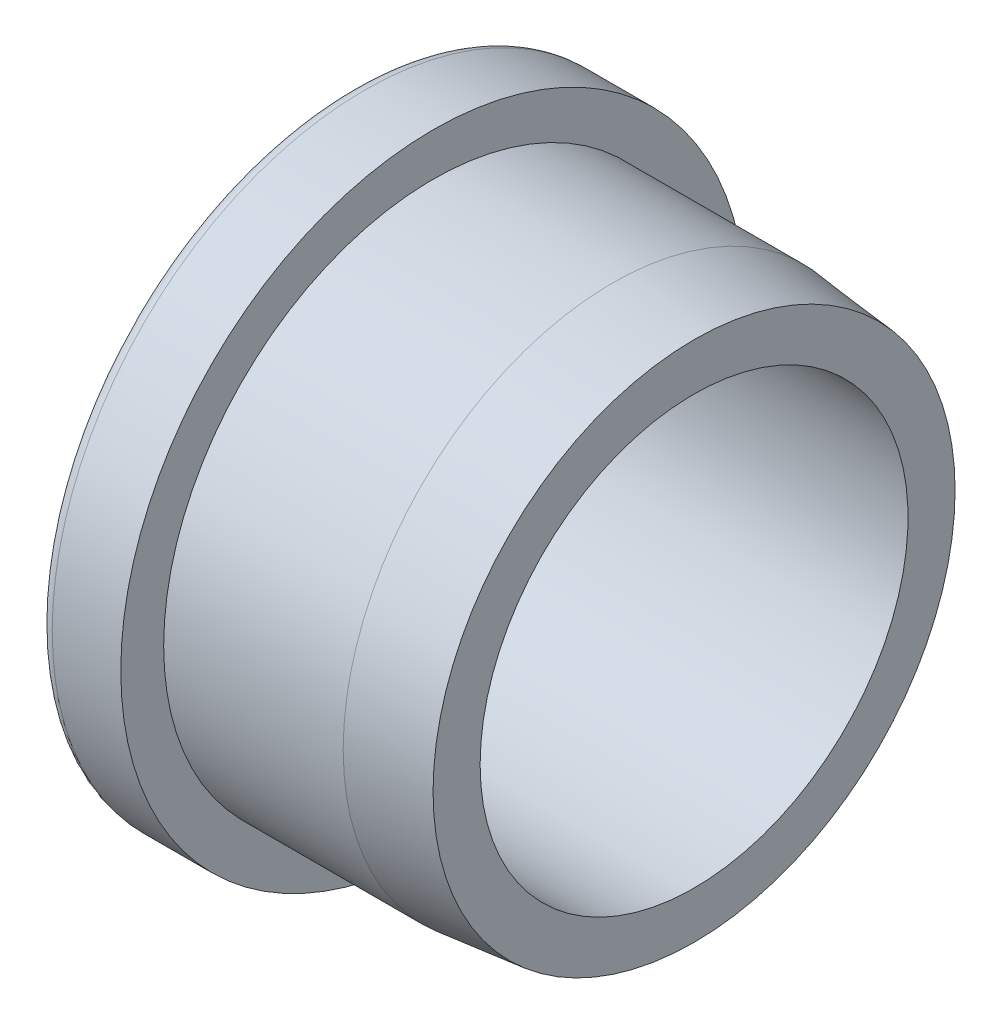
from build123d import *

# Parameters (mm, degrees)
CONG_2_R = 0.3


with BuildPart() as part:
    # Esquisse1 → Base-R_volution (revolve)
    with BuildSketch(Plane.XY, mode=Mode.PRIVATE) as base_r_volution_sk:
        Polygon((0, 5), (8, 5), (8, 6.1), (6.097617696, 6.297801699), (1.902382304, 6.297801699), (1.902382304, 7.3), (0, 7.3), align=None)
    revolve(base_r_volution_sk.sketch.rotate(Axis((-1.1, 0, 0), (1, 0, 0)), 90), axis=Axis((-1.1, 0, 0), (1, 0, 0)))

    # Cong_2
    cong_2_edges = [part.edges().sort_by_distance(p)[0] for p in [
        (0, 0, -5),
        (0, 0, -7.3),
    ]]
    fillet(cong_2_edges, radius=CONG_2_R)


solid = part.part
